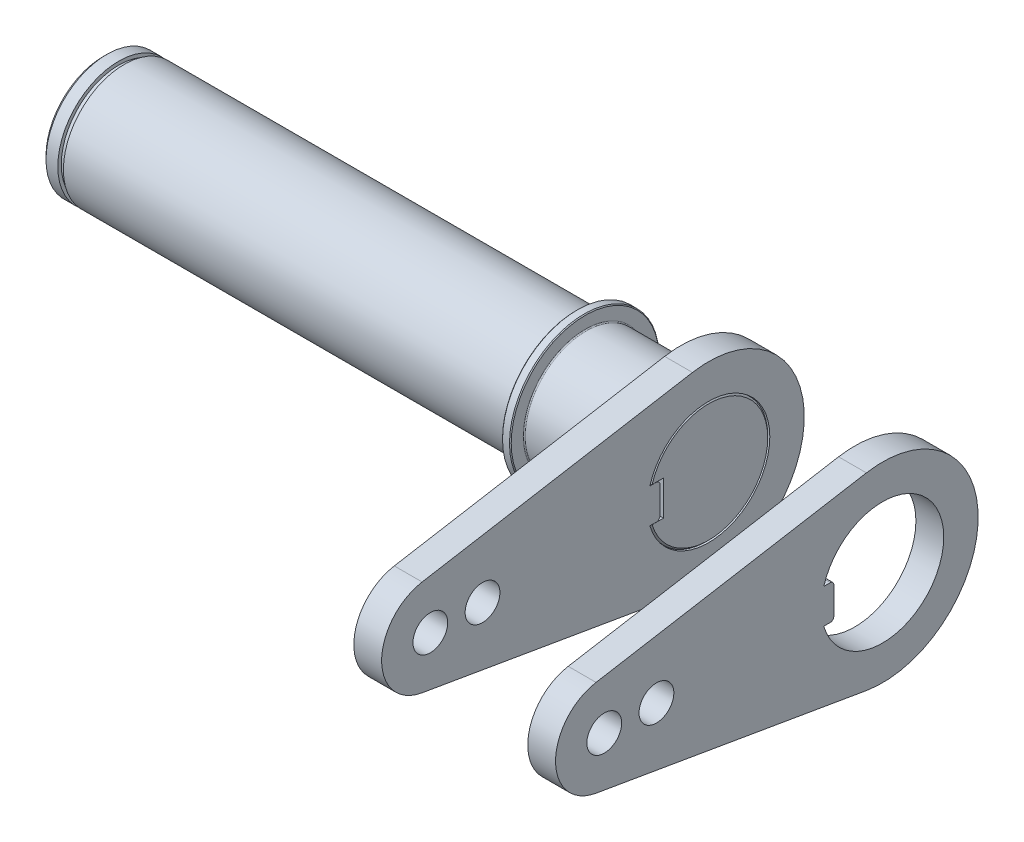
from build123d import *

# Parameters (mm, degrees)
ESQUISSE2_R                = 5
BOSS_EXTRU_1_DEPTH         = 8
ENL_V_MAT_EXTRU_6_DEPTH    = 5
R_P_TITION_LIN_AIRE3_COUNT = 2
R_P_TITION_LIN_AIRE3_PITCH = 50


with BuildPart() as part:
    # Esquisse1 → R_volution1 (revolve)
    with BuildSketch(Plane.XY, mode=Mode.PRIVATE) as r_volution1_sk:
        with BuildLine():
            Line((0, 0), (34.5, 0))
            Line((34.5, 0), (34.5, 17))
            Line((34.5, 17), (34, 17.5))
            Line((34, 17.5), (-0.7, 17.5))
            ThreePointArc((-0.7, 17.5), (-0.912132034, 17.587867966), (-1, 17.8))
            Line((-1, 17.8), (-1, 21.25))
            Line((-1, 21.25), (-1.25, 21.5))
            Line((-1.25, 21.5), (-3.25, 21.5))
            Line((-3.25, 21.5), (-3.5, 21.25))
            Line((-3.5, 21.25), (-3.5, 17.5))
            Line((-3.5, 17.5), (-133.5, 17.5))
            Line((-133.5, 17.5), (-133.5, 16.5))
            Line((-133.5, 16.5), (-135.1, 16.5))
            Line((-135.1, 16.5), (-135.1, 17.5))
            Line((-135.1, 17.5), (-138.5, 17.5))
            Line((-138.5, 17.5), (-139.5, 16.5))
            Line((-139.5, 16.5), (-139.5, 0))
            Line((-139.5, 0), (0, 0))
        make_face()
    revolve(r_volution1_sk.sketch.rotate(Axis((-139.5, 0, 0), (1, 0, 0)), 90), axis=Axis((-139.5, 0, 0), (1, 0, 0)))

    # Esquisse14 → Enl_v. mat.-Extru.6 (cut, symmetric)
    with BuildSketch(Plane(origin=(0, 0, 0), x_dir=(1, 0, 0), z_dir=(0, 1, 0))):
        with BuildLine():
            Line((55.759607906, -13), (24.5, -13))
            ThreePointArc((24.5, -13), (19.75658351, -14.196591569), (16.148353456, -17.5))
            Line((16.148353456, -17.5), (55.759607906, -19.906029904))
            Line((55.759607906, -19.906029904), (55.759607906, -13))
        make_face()
    extrude(amount=ENL_V_MAT_EXTRU_6_DEPTH, both=True, mode=Mode.SUBTRACT)


with BuildPart() as body_2:
    # Esquisse2 → Boss.-Extru.1 (new body)
    with BuildSketch(Plane(origin=(34.5, 0, 0), x_dir=(0, 0, -1), z_dir=(1, 0, 0))):
        with BuildLine():
            Line((-4.640625, 27.105619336), (-82.3625, 13.799224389))
            ThreePointArc((-82.3625, 13.799224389), (-94, 0), (-82.3625, -13.799224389))
            Line((-82.3625, -13.799224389), (-4.640625, -27.105619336))
            ThreePointArc((-4.640625, -27.105619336), (27.5, 0), (-4.640625, 27.105619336))
        make_face()
        with Locations(Location((-80, 0, 0), (0, 0, 90))):
            Circle(ESQUISSE2_R, mode=Mode.SUBTRACT)
        with Locations(Location((-65, 0, 0), (0, 0, 90))):
            Circle(ESQUISSE2_R, mode=Mode.SUBTRACT)
        with BuildLine():
            Line((-16.889567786, 4.95), (-15, 4.95))
            ThreePointArc((-15, 4.95), (-14.292893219, 4.657106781), (-14, 3.95))
            Line((-14, 3.95), (-14, -3.95))
            ThreePointArc((-14, -3.95), (-14.292893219, -4.657106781), (-15, -4.95))
            Line((-15, -4.95), (-16.889567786, -4.95))
            ThreePointArc((-16.889567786, -4.95), (17.6, 0), (-16.889567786, 4.95))
        make_face(mode=Mode.SUBTRACT)
    extrude(amount=-BOSS_EXTRU_1_DEPTH)


with BuildPart() as r_p_tition_lin_aire3_1:
    # R_p_tition lin_aire3: pattern copy
    add(body_2.part.moved(Location(Vector(1, 0, 0) * (1 * R_P_TITION_LIN_AIRE3_PITCH))))


solid = Compound([part.part, body_2.part, r_p_tition_lin_aire3_1.part])
